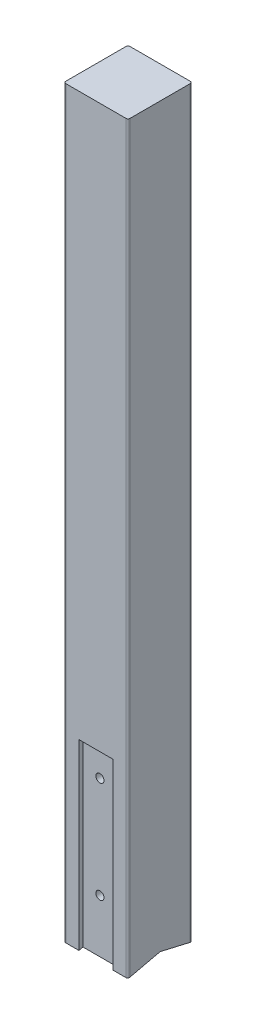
ISO-10303-21;
HEADER;
FILE_DESCRIPTION(('STEP AP214'),'2;1');
FILE_NAME('part.step','',(''),(''),'','','');
FILE_SCHEMA(('AUTOMOTIVE_DESIGN { 1 0 10303 214 1 1 1 1 }'));
ENDSEC;
DATA;
#1=APPLICATION_CONTEXT('core data for automotive mechanical design processes');
#2=APPLICATION_PROTOCOL_DEFINITION('international standard','automotive_design',2000,#1);
#3=PRODUCT_CONTEXT('',#1,'mechanical');
#4=PRODUCT('Part','Part','',(#3));
#5=PRODUCT_RELATED_PRODUCT_CATEGORY('part','',(#4));
#6=PRODUCT_DEFINITION_FORMATION('','',#4);
#7=PRODUCT_DEFINITION_CONTEXT('part definition',#1,'design');
#8=PRODUCT_DEFINITION('design','',#6,#7);
#9=PRODUCT_DEFINITION_SHAPE('','',#8);
#10=(LENGTH_UNIT() NAMED_UNIT(*) SI_UNIT(.MILLI.,.METRE.));
#11=(NAMED_UNIT(*) PLANE_ANGLE_UNIT() SI_UNIT($,.RADIAN.));
#12=(NAMED_UNIT(*) SI_UNIT($,.STERADIAN.) SOLID_ANGLE_UNIT());
#13=UNCERTAINTY_MEASURE_WITH_UNIT(LENGTH_MEASURE(1.E-05),#10,'distance_accuracy_value','');
#14=(GEOMETRIC_REPRESENTATION_CONTEXT(3) GLOBAL_UNCERTAINTY_ASSIGNED_CONTEXT((#13)) GLOBAL_UNIT_ASSIGNED_CONTEXT((#10,
#11,#12)) REPRESENTATION_CONTEXT('',''));
#15=CARTESIAN_POINT('',(0.,0.,0.));
#16=DIRECTION('',(0.,0.,1.));
#17=DIRECTION('',(1.,0.,0.));
#18=AXIS2_PLACEMENT_3D('',#15,#16,#17);
#19=CARTESIAN_POINT('',(0.,230.,47.501));
#20=DIRECTION('',(0.,0.,-1.));
#21=DIRECTION('',(-1.,0.,0.));
#22=AXIS2_PLACEMENT_3D('',#19,#20,#21);
#23=CYLINDRICAL_SURFACE('',#22,6.00000000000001);
#24=CARTESIAN_POINT('',(0.,230.,41.5));
#25=DIRECTION('',(0.,0.,1.));
#26=DIRECTION('',(1.,0.,0.));
#27=AXIS2_PLACEMENT_3D('',#24,#25,#26);
#28=CIRCLE('',#27,6.00000000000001);
#29=CARTESIAN_POINT('',(5.99999999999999,230.,41.5));
#30=VERTEX_POINT('',#29);
#31=EDGE_CURVE('E275',#30,#30,#28,.T.);
#32=ORIENTED_EDGE('',*,*,#31,.T.);
#33=EDGE_LOOP('',(#32));
#34=FACE_BOUND('',#33,.T.);
#35=CARTESIAN_POINT('',(0.,230.,-41.5));
#36=DIRECTION('',(0.,0.,-1.));
#37=DIRECTION('',(-1.,0.,0.));
#38=AXIS2_PLACEMENT_3D('',#35,#36,#37);
#39=CIRCLE('',#38,6.00000000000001);
#40=CARTESIAN_POINT('',(-6.00000000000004,230.,-41.5));
#41=VERTEX_POINT('',#40);
#42=EDGE_CURVE('E250',#41,#41,#39,.T.);
#43=ORIENTED_EDGE('',*,*,#42,.T.);
#44=EDGE_LOOP('',(#43));
#45=FACE_BOUND('',#44,.T.);
#46=ADVANCED_FACE('F26',(#34,#45),#23,.F.);
#47=CARTESIAN_POINT('',(0.,80.0000000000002,47.501));
#48=DIRECTION('',(0.,0.,-1.));
#49=DIRECTION('',(-1.,0.,0.));
#50=AXIS2_PLACEMENT_3D('',#47,#48,#49);
#51=CYLINDRICAL_SURFACE('',#50,6.00000000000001);
#52=CARTESIAN_POINT('',(0.,80.0000000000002,41.5));
#53=DIRECTION('',(0.,0.,1.));
#54=DIRECTION('',(1.,0.,0.));
#55=AXIS2_PLACEMENT_3D('',#52,#53,#54);
#56=CIRCLE('',#55,6.00000000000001);
#57=CARTESIAN_POINT('',(6.,80.0000000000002,41.5));
#58=VERTEX_POINT('',#57);
#59=EDGE_CURVE('E272',#58,#58,#56,.T.);
#60=ORIENTED_EDGE('',*,*,#59,.T.);
#61=EDGE_LOOP('',(#60));
#62=FACE_BOUND('',#61,.T.);
#63=CARTESIAN_POINT('',(0.,80.0000000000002,-41.5));
#64=DIRECTION('',(0.,0.,-1.));
#65=DIRECTION('',(-1.,0.,0.));
#66=AXIS2_PLACEMENT_3D('',#63,#64,#65);
#67=CIRCLE('',#66,6.00000000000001);
#68=CARTESIAN_POINT('',(-6.00000000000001,80.0000000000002,-41.5));
#69=VERTEX_POINT('',#68);
#70=EDGE_CURVE('E244',#69,#69,#67,.T.);
#71=ORIENTED_EDGE('',*,*,#70,.T.);
#72=EDGE_LOOP('',(#71));
#73=FACE_BOUND('',#72,.T.);
#74=ADVANCED_FACE('F337',(#62,#73),#51,.F.);
#75=CARTESIAN_POINT('',(-47.4999999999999,1100.,-47.5));
#76=DIRECTION('',(0.,0.,1.));
#77=DIRECTION('',(1.,0.,0.));
#78=AXIS2_PLACEMENT_3D('',#75,#76,#77);
#79=PLANE('',#78);
#80=DIRECTION('',(0.,-1.,0.));
#81=VECTOR('',#80,1.);
#82=CARTESIAN_POINT('',(-25.,270.,-47.5));
#83=LINE('',#82,#81);
#84=CARTESIAN_POINT('',(-25.,270.,-47.5));
#85=VERTEX_POINT('',#84);
#86=CARTESIAN_POINT('',(-25.,0.,-47.5));
#87=VERTEX_POINT('',#86);
#88=EDGE_CURVE('E147',#85,#87,#83,.T.);
#89=ORIENTED_EDGE('',*,*,#88,.T.);
#90=DIRECTION('',(-1.,0.,0.));
#91=VECTOR('',#90,1.);
#92=CARTESIAN_POINT('',(-47.4999999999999,0.,-47.5));
#93=LINE('',#92,#91);
#94=CARTESIAN_POINT('',(-44.4999999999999,0.,-47.5));
#95=VERTEX_POINT('',#94);
#96=EDGE_CURVE('E156',#87,#95,#93,.T.);
#97=ORIENTED_EDGE('',*,*,#96,.T.);
#98=DIRECTION('',(0.,-1.,0.));
#99=VECTOR('',#98,1.);
#100=CARTESIAN_POINT('',(-44.4999999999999,1100.,-47.5));
#101=LINE('',#100,#99);
#102=CARTESIAN_POINT('',(-44.4999999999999,1100.,-47.5));
#103=VERTEX_POINT('',#102);
#104=EDGE_CURVE('E200',#95,#103,#101,.F.);
#105=ORIENTED_EDGE('',*,*,#104,.T.);
#106=DIRECTION('',(-1.,0.,0.));
#107=VECTOR('',#106,1.);
#108=CARTESIAN_POINT('',(-47.4999999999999,1100.,-47.5));
#109=LINE('',#108,#107);
#110=CARTESIAN_POINT('',(44.4999999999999,1100.,-47.5));
#111=VERTEX_POINT('',#110);
#112=EDGE_CURVE('E177',#111,#103,#109,.T.);
#113=ORIENTED_EDGE('',*,*,#112,.F.);
#114=DIRECTION('',(0.,-1.,0.));
#115=VECTOR('',#114,1.);
#116=CARTESIAN_POINT('',(44.4999999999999,1100.,-47.5));
#117=LINE('',#116,#115);
#118=CARTESIAN_POINT('',(44.4999999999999,0.,-47.5));
#119=VERTEX_POINT('',#118);
#120=EDGE_CURVE('E197',#111,#119,#117,.T.);
#121=ORIENTED_EDGE('',*,*,#120,.T.);
#122=CARTESIAN_POINT('',(24.9999999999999,0.,-47.5));
#123=VERTEX_POINT('',#122);
#124=EDGE_CURVE('E165',#119,#123,#93,.T.);
#125=ORIENTED_EDGE('',*,*,#124,.T.);
#126=DIRECTION('',(0.,-1.,0.));
#127=VECTOR('',#126,1.);
#128=CARTESIAN_POINT('',(25.,270.,-47.5));
#129=LINE('',#128,#127);
#130=CARTESIAN_POINT('',(25.,270.,-47.5));
#131=VERTEX_POINT('',#130);
#132=EDGE_CURVE('E41',#131,#123,#129,.T.);
#133=ORIENTED_EDGE('',*,*,#132,.F.);
#134=DIRECTION('',(-1.,0.,0.));
#135=VECTOR('',#134,1.);
#136=CARTESIAN_POINT('',(-25.,270.,-47.5));
#137=LINE('',#136,#135);
#138=EDGE_CURVE('E159',#131,#85,#137,.T.);
#139=ORIENTED_EDGE('',*,*,#138,.T.);
#140=EDGE_LOOP('',(#89,#97,#105,#113,#121,#125,#133,#139));
#141=FACE_BOUND('',#140,.T.);
#142=ADVANCED_FACE('F28',(#141),#79,.F.);
#143=CARTESIAN_POINT('',(1444.59271754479,0.,-47.5));
#144=DIRECTION('',(0.,-0.974218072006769,0.22560839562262));
#145=DIRECTION('',(0.,-0.22560839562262,-0.97421807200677));
#146=AXIS2_PLACEMENT_3D('',#143,#144,#145);
#147=PLANE('',#146);
#148=ORIENTED_EDGE('',*,*,#96,.F.);
#149=DIRECTION('',(0.,0.22560839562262,0.97421807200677));
#150=VECTOR('',#149,1.);
#151=CARTESIAN_POINT('',(-24.9999999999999,1.86774434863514E-13,-47.4999999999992));
#152=LINE('',#151,#150);
#153=CARTESIAN_POINT('',(-25.,1.38947368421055,-41.5));
#154=VERTEX_POINT('',#153);
#155=EDGE_CURVE('E11',#87,#154,#152,.T.);
#156=ORIENTED_EDGE('',*,*,#155,.T.);
#157=DIRECTION('',(1.,0.,0.));
#158=VECTOR('',#157,1.);
#159=CARTESIAN_POINT('',(1444.59271754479,1.38947368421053,-41.5));
#160=LINE('',#159,#158);
#161=CARTESIAN_POINT('',(25.,1.38947368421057,-41.5));
#162=VERTEX_POINT('',#161);
#163=EDGE_CURVE('E34',#154,#162,#160,.T.);
#164=ORIENTED_EDGE('',*,*,#163,.T.);
#165=DIRECTION('',(0.,-0.22560839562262,-0.97421807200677));
#166=VECTOR('',#165,1.);
#167=CARTESIAN_POINT('',(24.9999999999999,-1.80419802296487E-13,-47.5000000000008));
#168=LINE('',#167,#166);
#169=EDGE_CURVE('E234',#162,#123,#168,.T.);
#170=ORIENTED_EDGE('',*,*,#169,.T.);
#171=ORIENTED_EDGE('',*,*,#124,.F.);
#172=CARTESIAN_POINT('',(44.4999999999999,0.694736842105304,-44.5));
#173=DIRECTION('',(0.,-0.974218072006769,0.22560839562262));
#174=DIRECTION('',(0.,-0.22560839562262,-0.97421807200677));
#175=AXIS2_PLACEMENT_3D('',#172,#173,#174);
#176=ELLIPSE('',#175,3.0793926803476,3.);
#177=CARTESIAN_POINT('',(47.4999999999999,0.694736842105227,-44.5));
#178=VERTEX_POINT('',#177);
#179=EDGE_CURVE('E194',#119,#178,#176,.T.);
#180=ORIENTED_EDGE('',*,*,#179,.T.);
#181=DIRECTION('',(0.,0.22560839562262,0.97421807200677));
#182=VECTOR('',#181,1.);
#183=CARTESIAN_POINT('',(47.5000000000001,55.989062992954,194.270953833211));
#184=LINE('',#183,#182);
#185=CARTESIAN_POINT('',(47.4999999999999,11.,0.));
#186=VERTEX_POINT('',#185);
#187=EDGE_CURVE('E281',#178,#186,#184,.T.);
#188=ORIENTED_EDGE('',*,*,#187,.T.);
#189=DIRECTION('',(-1.,0.,0.));
#190=VECTOR('',#189,1.);
#191=CARTESIAN_POINT('',(1444.59271754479,11.,0.));
#192=LINE('',#191,#190);
#193=CARTESIAN_POINT('',(-47.4999999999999,11.,0.));
#194=VERTEX_POINT('',#193);
#195=EDGE_CURVE('E278',#186,#194,#192,.T.);
#196=ORIENTED_EDGE('',*,*,#195,.T.);
#197=DIRECTION('',(0.,-0.22560839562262,-0.97421807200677));
#198=VECTOR('',#197,1.);
#199=CARTESIAN_POINT('',(-47.5000000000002,55.989062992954,194.270953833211));
#200=LINE('',#199,#198);
#201=CARTESIAN_POINT('',(-47.4999999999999,0.694736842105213,-44.5000000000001));
#202=VERTEX_POINT('',#201);
#203=EDGE_CURVE('E283',#194,#202,#200,.T.);
#204=ORIENTED_EDGE('',*,*,#203,.T.);
#205=CARTESIAN_POINT('',(-44.4999999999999,0.694736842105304,-44.5));
#206=DIRECTION('',(0.,-0.974218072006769,0.22560839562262));
#207=DIRECTION('',(0.,-0.22560839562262,-0.97421807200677));
#208=AXIS2_PLACEMENT_3D('',#205,#206,#207);
#209=ELLIPSE('',#208,3.0793926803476,3.);
#210=EDGE_CURVE('E163',#202,#95,#209,.T.);
#211=ORIENTED_EDGE('',*,*,#210,.T.);
#212=EDGE_LOOP('',(#148,#156,#164,#170,#171,#180,#188,#196,#204,#211));
#213=FACE_BOUND('',#212,.T.);
#214=ADVANCED_FACE('F161',(#213),#147,.T.);
#215=CARTESIAN_POINT('',(-47.5,1100.,47.5));
#216=DIRECTION('',(0.,0.,-1.));
#217=DIRECTION('',(-1.,0.,0.));
#218=AXIS2_PLACEMENT_3D('',#215,#216,#217);
#219=PLANE('',#218);
#220=DIRECTION('',(0.,-1.,0.));
#221=VECTOR('',#220,1.);
#222=CARTESIAN_POINT('',(-25.,270.,47.5));
#223=LINE('',#222,#221);
#224=CARTESIAN_POINT('',(-25.,270.,47.5));
#225=VERTEX_POINT('',#224);
#226=CARTESIAN_POINT('',(-25.,0.,47.5));
#227=VERTEX_POINT('',#226);
#228=EDGE_CURVE('E270',#225,#227,#223,.T.);
#229=ORIENTED_EDGE('',*,*,#228,.F.);
#230=DIRECTION('',(1.,0.,0.));
#231=VECTOR('',#230,1.);
#232=CARTESIAN_POINT('',(-25.,270.,47.5));
#233=LINE('',#232,#231);
#234=CARTESIAN_POINT('',(25.,270.,47.5));
#235=VERTEX_POINT('',#234);
#236=EDGE_CURVE('E256',#225,#235,#233,.T.);
#237=ORIENTED_EDGE('',*,*,#236,.T.);
#238=DIRECTION('',(0.,-1.,0.));
#239=VECTOR('',#238,1.);
#240=CARTESIAN_POINT('',(25.,270.,47.5));
#241=LINE('',#240,#239);
#242=CARTESIAN_POINT('',(25.,0.,47.5));
#243=VERTEX_POINT('',#242);
#244=EDGE_CURVE('E267',#235,#243,#241,.T.);
#245=ORIENTED_EDGE('',*,*,#244,.T.);
#246=DIRECTION('',(1.,0.,0.));
#247=VECTOR('',#246,1.);
#248=CARTESIAN_POINT('',(-47.5,0.,47.5));
#249=LINE('',#248,#247);
#250=CARTESIAN_POINT('',(44.5,0.,47.5));
#251=VERTEX_POINT('',#250);
#252=EDGE_CURVE('E169',#243,#251,#249,.T.);
#253=ORIENTED_EDGE('',*,*,#252,.T.);
#254=DIRECTION('',(0.,-1.,0.));
#255=VECTOR('',#254,1.);
#256=CARTESIAN_POINT('',(44.5,1100.,47.5));
#257=LINE('',#256,#255);
#258=CARTESIAN_POINT('',(44.5,1100.,47.5));
#259=VERTEX_POINT('',#258);
#260=EDGE_CURVE('E223',#251,#259,#257,.F.);
#261=ORIENTED_EDGE('',*,*,#260,.T.);
#262=DIRECTION('',(1.,0.,0.));
#263=VECTOR('',#262,1.);
#264=CARTESIAN_POINT('',(-47.5,1100.,47.5));
#265=LINE('',#264,#263);
#266=CARTESIAN_POINT('',(-44.5,1100.,47.5));
#267=VERTEX_POINT('',#266);
#268=EDGE_CURVE('E183',#267,#259,#265,.T.);
#269=ORIENTED_EDGE('',*,*,#268,.F.);
#270=DIRECTION('',(0.,-1.,0.));
#271=VECTOR('',#270,1.);
#272=CARTESIAN_POINT('',(-44.5,1100.,47.5));
#273=LINE('',#272,#271);
#274=CARTESIAN_POINT('',(-44.5,0.,47.5));
#275=VERTEX_POINT('',#274);
#276=EDGE_CURVE('E220',#267,#275,#273,.T.);
#277=ORIENTED_EDGE('',*,*,#276,.T.);
#278=EDGE_CURVE('E174',#275,#227,#249,.T.);
#279=ORIENTED_EDGE('',*,*,#278,.T.);
#280=EDGE_LOOP('',(#229,#237,#245,#253,#261,#269,#277,#279));
#281=FACE_BOUND('',#280,.T.);
#282=ADVANCED_FACE('F303',(#281),#219,.F.);
#283=CARTESIAN_POINT('',(1444.59271754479,11.,0.));
#284=DIRECTION('',(0.,-0.974218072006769,-0.22560839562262));
#285=DIRECTION('',(0.,0.22560839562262,-0.97421807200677));
#286=AXIS2_PLACEMENT_3D('',#283,#284,#285);
#287=PLANE('',#286);
#288=DIRECTION('',(-1.,0.,0.));
#289=VECTOR('',#288,1.);
#290=CARTESIAN_POINT('',(1444.59271754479,1.38947368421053,41.5));
#291=LINE('',#290,#289);
#292=CARTESIAN_POINT('',(25.,1.38947368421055,41.5));
#293=VERTEX_POINT('',#292);
#294=CARTESIAN_POINT('',(-24.9999999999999,1.38947368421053,41.5));
#295=VERTEX_POINT('',#294);
#296=EDGE_CURVE('E225',#293,#295,#291,.T.);
#297=ORIENTED_EDGE('',*,*,#296,.T.);
#298=DIRECTION('',(0.,-0.22560839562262,0.97421807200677));
#299=VECTOR('',#298,1.);
#300=CARTESIAN_POINT('',(-24.9999999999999,11.,0.));
#301=LINE('',#300,#299);
#302=EDGE_CURVE('E231',#295,#227,#301,.T.);
#303=ORIENTED_EDGE('',*,*,#302,.T.);
#304=ORIENTED_EDGE('',*,*,#278,.F.);
#305=CARTESIAN_POINT('',(-44.5,0.694736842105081,44.5));
#306=DIRECTION('',(0.,-0.974218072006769,-0.22560839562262));
#307=DIRECTION('',(0.,-0.22560839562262,0.97421807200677));
#308=AXIS2_PLACEMENT_3D('',#305,#306,#307);
#309=ELLIPSE('',#308,3.0793926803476,3.);
#310=CARTESIAN_POINT('',(-47.5,0.694736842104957,44.5000000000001));
#311=VERTEX_POINT('',#310);
#312=EDGE_CURVE('E215',#275,#311,#309,.T.);
#313=ORIENTED_EDGE('',*,*,#312,.T.);
#314=DIRECTION('',(0.,0.22560839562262,-0.97421807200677));
#315=VECTOR('',#314,1.);
#316=CARTESIAN_POINT('',(-47.4999999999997,76.8692817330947,-284.435534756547));
#317=LINE('',#316,#315);
#318=EDGE_CURVE('E166',#311,#194,#317,.T.);
#319=ORIENTED_EDGE('',*,*,#318,.T.);
#320=ORIENTED_EDGE('',*,*,#195,.F.);
#321=DIRECTION('',(0.,-0.22560839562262,0.97421807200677));
#322=VECTOR('',#321,1.);
#323=CARTESIAN_POINT('',(47.4999999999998,76.8692817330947,-284.435534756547));
#324=LINE('',#323,#322);
#325=CARTESIAN_POINT('',(47.5,0.694736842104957,44.5000000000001));
#326=VERTEX_POINT('',#325);
#327=EDGE_CURVE('E170',#186,#326,#324,.T.);
#328=ORIENTED_EDGE('',*,*,#327,.T.);
#329=CARTESIAN_POINT('',(44.5,0.694736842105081,44.5));
#330=DIRECTION('',(0.,-0.974218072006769,-0.22560839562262));
#331=DIRECTION('',(0.,-0.22560839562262,0.97421807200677));
#332=AXIS2_PLACEMENT_3D('',#329,#330,#331);
#333=ELLIPSE('',#332,3.0793926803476,3.);
#334=EDGE_CURVE('E217',#326,#251,#333,.T.);
#335=ORIENTED_EDGE('',*,*,#334,.T.);
#336=ORIENTED_EDGE('',*,*,#252,.F.);
#337=DIRECTION('',(0.,0.22560839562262,-0.97421807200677));
#338=VECTOR('',#337,1.);
#339=CARTESIAN_POINT('',(24.9999999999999,11.,0.));
#340=LINE('',#339,#338);
#341=EDGE_CURVE('E228',#243,#293,#340,.T.);
#342=ORIENTED_EDGE('',*,*,#341,.T.);
#343=EDGE_LOOP('',(#297,#303,#304,#313,#319,#320,#328,#335,#336,#342));
#344=FACE_BOUND('',#343,.T.);
#345=ADVANCED_FACE('F288',(#344),#287,.T.);
#346=CARTESIAN_POINT('',(-47.4999999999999,1100.,-47.5));
#347=DIRECTION('',(1.,0.,0.));
#348=DIRECTION('',(0.,0.,-1.));
#349=AXIS2_PLACEMENT_3D('',#346,#347,#348);
#350=PLANE('',#349);
#351=DIRECTION('',(0.,0.,1.));
#352=VECTOR('',#351,1.);
#353=CARTESIAN_POINT('',(-47.4999999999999,1100.,-47.5));
#354=LINE('',#353,#352);
#355=CARTESIAN_POINT('',(-47.4999999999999,1100.,-44.5));
#356=VERTEX_POINT('',#355);
#357=CARTESIAN_POINT('',(-47.5,1100.,44.5));
#358=VERTEX_POINT('',#357);
#359=EDGE_CURVE('E180',#356,#358,#354,.T.);
#360=ORIENTED_EDGE('',*,*,#359,.F.);
#361=DIRECTION('',(0.,-1.,0.));
#362=VECTOR('',#361,1.);
#363=CARTESIAN_POINT('',(-47.4999999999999,1100.,-44.5));
#364=LINE('',#363,#362);
#365=EDGE_CURVE('E191',#356,#202,#364,.T.);
#366=ORIENTED_EDGE('',*,*,#365,.T.);
#367=ORIENTED_EDGE('',*,*,#203,.F.);
#368=ORIENTED_EDGE('',*,*,#318,.F.);
#369=DIRECTION('',(0.,-1.,0.));
#370=VECTOR('',#369,1.);
#371=CARTESIAN_POINT('',(-47.5,1100.,44.5));
#372=LINE('',#371,#370);
#373=EDGE_CURVE('E189',#311,#358,#372,.F.);
#374=ORIENTED_EDGE('',*,*,#373,.T.);
#375=EDGE_LOOP('',(#360,#366,#367,#368,#374));
#376=FACE_BOUND('',#375,.T.);
#377=ADVANCED_FACE('F354',(#376),#350,.F.);
#378=CARTESIAN_POINT('',(47.4999999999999,1100.,-47.5));
#379=DIRECTION('',(-1.,0.,0.));
#380=DIRECTION('',(0.,0.,1.));
#381=AXIS2_PLACEMENT_3D('',#378,#379,#380);
#382=PLANE('',#381);
#383=ORIENTED_EDGE('',*,*,#187,.F.);
#384=DIRECTION('',(0.,-1.,0.));
#385=VECTOR('',#384,1.);
#386=CARTESIAN_POINT('',(47.4999999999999,1100.,-44.5));
#387=LINE('',#386,#385);
#388=CARTESIAN_POINT('',(47.4999999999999,1100.,-44.5));
#389=VERTEX_POINT('',#388);
#390=EDGE_CURVE('E213',#178,#389,#387,.F.);
#391=ORIENTED_EDGE('',*,*,#390,.T.);
#392=DIRECTION('',(0.,0.,-1.));
#393=VECTOR('',#392,1.);
#394=CARTESIAN_POINT('',(47.4999999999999,1100.,-47.5));
#395=LINE('',#394,#393);
#396=CARTESIAN_POINT('',(47.5,1100.,44.5));
#397=VERTEX_POINT('',#396);
#398=EDGE_CURVE('E186',#397,#389,#395,.T.);
#399=ORIENTED_EDGE('',*,*,#398,.F.);
#400=DIRECTION('',(0.,-1.,0.));
#401=VECTOR('',#400,1.);
#402=CARTESIAN_POINT('',(47.5,1100.,44.5));
#403=LINE('',#402,#401);
#404=EDGE_CURVE('E210',#397,#326,#403,.T.);
#405=ORIENTED_EDGE('',*,*,#404,.T.);
#406=ORIENTED_EDGE('',*,*,#327,.F.);
#407=EDGE_LOOP('',(#383,#391,#399,#405,#406));
#408=FACE_BOUND('',#407,.T.);
#409=ADVANCED_FACE('F293',(#408),#382,.F.);
#410=CARTESIAN_POINT('',(47.4999999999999,1100.,-47.5));
#411=DIRECTION('',(0.,-1.,0.));
#412=DIRECTION('',(0.,0.,-1.));
#413=AXIS2_PLACEMENT_3D('',#410,#411,#412);
#414=PLANE('',#413);
#415=ORIENTED_EDGE('',*,*,#112,.T.);
#416=CARTESIAN_POINT('',(-44.4999999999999,1100.,-44.5));
#417=DIRECTION('',(0.,-1.,0.));
#418=DIRECTION('',(0.,0.,-1.));
#419=AXIS2_PLACEMENT_3D('',#416,#417,#418);
#420=CIRCLE('',#419,3.);
#421=EDGE_CURVE('E208',#103,#356,#420,.F.);
#422=ORIENTED_EDGE('',*,*,#421,.T.);
#423=ORIENTED_EDGE('',*,*,#359,.T.);
#424=CARTESIAN_POINT('',(-44.5,1100.,44.5));
#425=DIRECTION('',(0.,-1.,0.));
#426=DIRECTION('',(0.,0.,-1.));
#427=AXIS2_PLACEMENT_3D('',#424,#425,#426);
#428=CIRCLE('',#427,3.);
#429=EDGE_CURVE('E202',#358,#267,#428,.F.);
#430=ORIENTED_EDGE('',*,*,#429,.T.);
#431=ORIENTED_EDGE('',*,*,#268,.T.);
#432=CARTESIAN_POINT('',(44.5,1100.,44.5));
#433=DIRECTION('',(0.,-1.,0.));
#434=DIRECTION('',(0.,0.,-1.));
#435=AXIS2_PLACEMENT_3D('',#432,#433,#434);
#436=CIRCLE('',#435,3.);
#437=EDGE_CURVE('E204',#259,#397,#436,.F.);
#438=ORIENTED_EDGE('',*,*,#437,.T.);
#439=ORIENTED_EDGE('',*,*,#398,.T.);
#440=CARTESIAN_POINT('',(44.4999999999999,1100.,-44.5));
#441=DIRECTION('',(0.,-1.,0.));
#442=DIRECTION('',(0.,0.,-1.));
#443=AXIS2_PLACEMENT_3D('',#440,#441,#442);
#444=CIRCLE('',#443,3.);
#445=EDGE_CURVE('E206',#389,#111,#444,.F.);
#446=ORIENTED_EDGE('',*,*,#445,.T.);
#447=EDGE_LOOP('',(#415,#422,#423,#430,#431,#438,#439,#446));
#448=FACE_BOUND('',#447,.T.);
#449=ADVANCED_FACE('F306',(#448),#414,.F.);
#450=CARTESIAN_POINT('',(-44.4999999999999,1100.,-44.5));
#451=DIRECTION('',(0.,-1.,0.));
#452=DIRECTION('',(0.,0.,-1.));
#453=AXIS2_PLACEMENT_3D('',#450,#451,#452);
#454=CYLINDRICAL_SURFACE('',#453,3.);
#455=ORIENTED_EDGE('',*,*,#421,.F.);
#456=ORIENTED_EDGE('',*,*,#104,.F.);
#457=ORIENTED_EDGE('',*,*,#210,.F.);
#458=ORIENTED_EDGE('',*,*,#365,.F.);
#459=EDGE_LOOP('',(#455,#456,#457,#458));
#460=FACE_BOUND('',#459,.T.);
#461=ADVANCED_FACE('F351',(#460),#454,.T.);
#462=CARTESIAN_POINT('',(44.4999999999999,1100.,-44.5));
#463=DIRECTION('',(0.,-1.,0.));
#464=DIRECTION('',(0.,0.,-1.));
#465=AXIS2_PLACEMENT_3D('',#462,#463,#464);
#466=CYLINDRICAL_SURFACE('',#465,3.);
#467=ORIENTED_EDGE('',*,*,#445,.F.);
#468=ORIENTED_EDGE('',*,*,#390,.F.);
#469=ORIENTED_EDGE('',*,*,#179,.F.);
#470=ORIENTED_EDGE('',*,*,#120,.F.);
#471=EDGE_LOOP('',(#467,#468,#469,#470));
#472=FACE_BOUND('',#471,.T.);
#473=ADVANCED_FACE('F369',(#472),#466,.T.);
#474=CARTESIAN_POINT('',(44.5,1100.,44.5));
#475=DIRECTION('',(0.,-1.,0.));
#476=DIRECTION('',(0.,0.,-1.));
#477=AXIS2_PLACEMENT_3D('',#474,#475,#476);
#478=CYLINDRICAL_SURFACE('',#477,3.);
#479=ORIENTED_EDGE('',*,*,#437,.F.);
#480=ORIENTED_EDGE('',*,*,#260,.F.);
#481=ORIENTED_EDGE('',*,*,#334,.F.);
#482=ORIENTED_EDGE('',*,*,#404,.F.);
#483=EDGE_LOOP('',(#479,#480,#481,#482));
#484=FACE_BOUND('',#483,.T.);
#485=ADVANCED_FACE('F299',(#484),#478,.T.);
#486=CARTESIAN_POINT('',(-44.5,1100.,44.5));
#487=DIRECTION('',(0.,-1.,0.));
#488=DIRECTION('',(0.,0.,-1.));
#489=AXIS2_PLACEMENT_3D('',#486,#487,#488);
#490=CYLINDRICAL_SURFACE('',#489,3.);
#491=ORIENTED_EDGE('',*,*,#429,.F.);
#492=ORIENTED_EDGE('',*,*,#373,.F.);
#493=ORIENTED_EDGE('',*,*,#312,.F.);
#494=ORIENTED_EDGE('',*,*,#276,.F.);
#495=EDGE_LOOP('',(#491,#492,#493,#494));
#496=FACE_BOUND('',#495,.T.);
#497=ADVANCED_FACE('F311',(#496),#490,.T.);
#498=CARTESIAN_POINT('',(-25.,270.,47.5));
#499=DIRECTION('',(1.,0.,0.));
#500=DIRECTION('',(0.,0.,-1.));
#501=AXIS2_PLACEMENT_3D('',#498,#499,#500);
#502=PLANE('',#501);
#503=DIRECTION('',(0.,-1.,0.));
#504=VECTOR('',#503,1.);
#505=CARTESIAN_POINT('',(-25.,270.,41.5));
#506=LINE('',#505,#504);
#507=CARTESIAN_POINT('',(-25.,270.,41.5));
#508=VERTEX_POINT('',#507);
#509=EDGE_CURVE('E49',#508,#295,#506,.T.);
#510=ORIENTED_EDGE('',*,*,#509,.F.);
#511=DIRECTION('',(0.,0.,1.));
#512=VECTOR('',#511,1.);
#513=CARTESIAN_POINT('',(-25.,270.,47.5));
#514=LINE('',#513,#512);
#515=EDGE_CURVE('E253',#508,#225,#514,.T.);
#516=ORIENTED_EDGE('',*,*,#515,.T.);
#517=ORIENTED_EDGE('',*,*,#228,.T.);
#518=ORIENTED_EDGE('',*,*,#302,.F.);
#519=EDGE_LOOP('',(#510,#516,#517,#518));
#520=FACE_BOUND('',#519,.T.);
#521=ADVANCED_FACE('F315',(#520),#502,.T.);
#522=CARTESIAN_POINT('',(25.,270.,47.5));
#523=DIRECTION('',(-1.,0.,0.));
#524=DIRECTION('',(0.,0.,1.));
#525=AXIS2_PLACEMENT_3D('',#522,#523,#524);
#526=PLANE('',#525);
#527=ORIENTED_EDGE('',*,*,#244,.F.);
#528=DIRECTION('',(0.,0.,-1.));
#529=VECTOR('',#528,1.);
#530=CARTESIAN_POINT('',(25.,270.,47.5));
#531=LINE('',#530,#529);
#532=CARTESIAN_POINT('',(25.,270.,41.5));
#533=VERTEX_POINT('',#532);
#534=EDGE_CURVE('E259',#235,#533,#531,.T.);
#535=ORIENTED_EDGE('',*,*,#534,.T.);
#536=DIRECTION('',(0.,-1.,0.));
#537=VECTOR('',#536,1.);
#538=CARTESIAN_POINT('',(25.,270.,41.5));
#539=LINE('',#538,#537);
#540=EDGE_CURVE('E264',#533,#293,#539,.T.);
#541=ORIENTED_EDGE('',*,*,#540,.T.);
#542=ORIENTED_EDGE('',*,*,#341,.F.);
#543=EDGE_LOOP('',(#527,#535,#541,#542));
#544=FACE_BOUND('',#543,.T.);
#545=ADVANCED_FACE('F323',(#544),#526,.T.);
#546=CARTESIAN_POINT('',(-25.,270.,41.5));
#547=DIRECTION('',(0.,0.,1.));
#548=DIRECTION('',(1.,0.,0.));
#549=AXIS2_PLACEMENT_3D('',#546,#547,#548);
#550=PLANE('',#549);
#551=ORIENTED_EDGE('',*,*,#31,.F.);
#552=EDGE_LOOP('',(#551));
#553=FACE_BOUND('',#552,.T.);
#554=ORIENTED_EDGE('',*,*,#59,.F.);
#555=EDGE_LOOP('',(#554));
#556=FACE_BOUND('',#555,.T.);
#557=ORIENTED_EDGE('',*,*,#540,.F.);
#558=DIRECTION('',(-1.,0.,0.));
#559=VECTOR('',#558,1.);
#560=CARTESIAN_POINT('',(-25.,270.,41.5));
#561=LINE('',#560,#559);
#562=EDGE_CURVE('E261',#533,#508,#561,.T.);
#563=ORIENTED_EDGE('',*,*,#562,.T.);
#564=ORIENTED_EDGE('',*,*,#509,.T.);
#565=ORIENTED_EDGE('',*,*,#296,.F.);
#566=EDGE_LOOP('',(#557,#563,#564,#565));
#567=FACE_BOUND('',#566,.T.);
#568=ADVANCED_FACE('F324',(#553,#556,#567),#550,.T.);
#569=CARTESIAN_POINT('',(-25.,270.,41.5));
#570=DIRECTION('',(0.,-1.,0.));
#571=DIRECTION('',(0.,0.,-1.));
#572=AXIS2_PLACEMENT_3D('',#569,#570,#571);
#573=PLANE('',#572);
#574=ORIENTED_EDGE('',*,*,#515,.F.);
#575=ORIENTED_EDGE('',*,*,#562,.F.);
#576=ORIENTED_EDGE('',*,*,#534,.F.);
#577=ORIENTED_EDGE('',*,*,#236,.F.);
#578=EDGE_LOOP('',(#574,#575,#576,#577));
#579=FACE_BOUND('',#578,.T.);
#580=ADVANCED_FACE('F319',(#579),#573,.T.);
#581=CARTESIAN_POINT('',(-25.,270.,-47.5));
#582=DIRECTION('',(1.,0.,0.));
#583=DIRECTION('',(0.,0.,-1.));
#584=AXIS2_PLACEMENT_3D('',#581,#582,#583);
#585=PLANE('',#584);
#586=ORIENTED_EDGE('',*,*,#88,.F.);
#587=DIRECTION('',(0.,0.,1.));
#588=VECTOR('',#587,1.);
#589=CARTESIAN_POINT('',(-25.,270.,-47.5));
#590=LINE('',#589,#588);
#591=CARTESIAN_POINT('',(-25.,270.,-41.5));
#592=VERTEX_POINT('',#591);
#593=EDGE_CURVE('E438',#85,#592,#590,.T.);
#594=ORIENTED_EDGE('',*,*,#593,.T.);
#595=DIRECTION('',(0.,-1.,0.));
#596=VECTOR('',#595,1.);
#597=CARTESIAN_POINT('',(-25.,270.,-41.5));
#598=LINE('',#597,#596);
#599=EDGE_CURVE('E150',#592,#154,#598,.T.);
#600=ORIENTED_EDGE('',*,*,#599,.T.);
#601=ORIENTED_EDGE('',*,*,#155,.F.);
#602=EDGE_LOOP('',(#586,#594,#600,#601));
#603=FACE_BOUND('',#602,.T.);
#604=ADVANCED_FACE('F145',(#603),#585,.T.);
#605=CARTESIAN_POINT('',(-25.,270.,-41.5));
#606=DIRECTION('',(0.,0.,-1.));
#607=DIRECTION('',(-1.,0.,0.));
#608=AXIS2_PLACEMENT_3D('',#605,#606,#607);
#609=PLANE('',#608);
#610=ORIENTED_EDGE('',*,*,#42,.F.);
#611=EDGE_LOOP('',(#610));
#612=FACE_BOUND('',#611,.T.);
#613=ORIENTED_EDGE('',*,*,#70,.F.);
#614=EDGE_LOOP('',(#613));
#615=FACE_BOUND('',#614,.T.);
#616=ORIENTED_EDGE('',*,*,#599,.F.);
#617=DIRECTION('',(1.,0.,0.));
#618=VECTOR('',#617,1.);
#619=CARTESIAN_POINT('',(-25.,270.,-41.5));
#620=LINE('',#619,#618);
#621=CARTESIAN_POINT('',(25.,270.,-41.5));
#622=VERTEX_POINT('',#621);
#623=EDGE_CURVE('E241',#592,#622,#620,.T.);
#624=ORIENTED_EDGE('',*,*,#623,.T.);
#625=DIRECTION('',(0.,-1.,0.));
#626=VECTOR('',#625,1.);
#627=CARTESIAN_POINT('',(25.,270.,-41.5));
#628=LINE('',#627,#626);
#629=EDGE_CURVE('E240',#622,#162,#628,.T.);
#630=ORIENTED_EDGE('',*,*,#629,.T.);
#631=ORIENTED_EDGE('',*,*,#163,.F.);
#632=EDGE_LOOP('',(#616,#624,#630,#631));
#633=FACE_BOUND('',#632,.T.);
#634=ADVANCED_FACE('F238',(#612,#615,#633),#609,.T.);
#635=CARTESIAN_POINT('',(25.,270.,-47.5));
#636=DIRECTION('',(-1.,0.,0.));
#637=DIRECTION('',(0.,0.,1.));
#638=AXIS2_PLACEMENT_3D('',#635,#636,#637);
#639=PLANE('',#638);
#640=ORIENTED_EDGE('',*,*,#629,.F.);
#641=DIRECTION('',(0.,0.,-1.));
#642=VECTOR('',#641,1.);
#643=CARTESIAN_POINT('',(25.,270.,-47.5));
#644=LINE('',#643,#642);
#645=EDGE_CURVE('E440',#622,#131,#644,.T.);
#646=ORIENTED_EDGE('',*,*,#645,.T.);
#647=ORIENTED_EDGE('',*,*,#132,.T.);
#648=ORIENTED_EDGE('',*,*,#169,.F.);
#649=EDGE_LOOP('',(#640,#646,#647,#648));
#650=FACE_BOUND('',#649,.T.);
#651=ADVANCED_FACE('F421',(#650),#639,.T.);
#652=CARTESIAN_POINT('',(-25.,270.,-41.5));
#653=DIRECTION('',(0.,1.,0.));
#654=DIRECTION('',(0.,0.,1.));
#655=AXIS2_PLACEMENT_3D('',#652,#653,#654);
#656=PLANE('',#655);
#657=ORIENTED_EDGE('',*,*,#593,.F.);
#658=ORIENTED_EDGE('',*,*,#138,.F.);
#659=ORIENTED_EDGE('',*,*,#645,.F.);
#660=ORIENTED_EDGE('',*,*,#623,.F.);
#661=EDGE_LOOP('',(#657,#658,#659,#660));
#662=FACE_BOUND('',#661,.T.);
#663=ADVANCED_FACE('F429',(#662),#656,.F.);
#664=CLOSED_SHELL('',(#46,#74,#142,#214,#282,#345,#377,#409,#449,#461,#473,#485,#497,#521,#545,
#568,#580,#604,#634,#651,#663));
#665=MANIFOLD_SOLID_BREP('B2',#664);
#666=ADVANCED_BREP_SHAPE_REPRESENTATION('',(#18,#665),#14);
#667=SHAPE_DEFINITION_REPRESENTATION(#9,#666);
ENDSEC;
END-ISO-10303-21;
